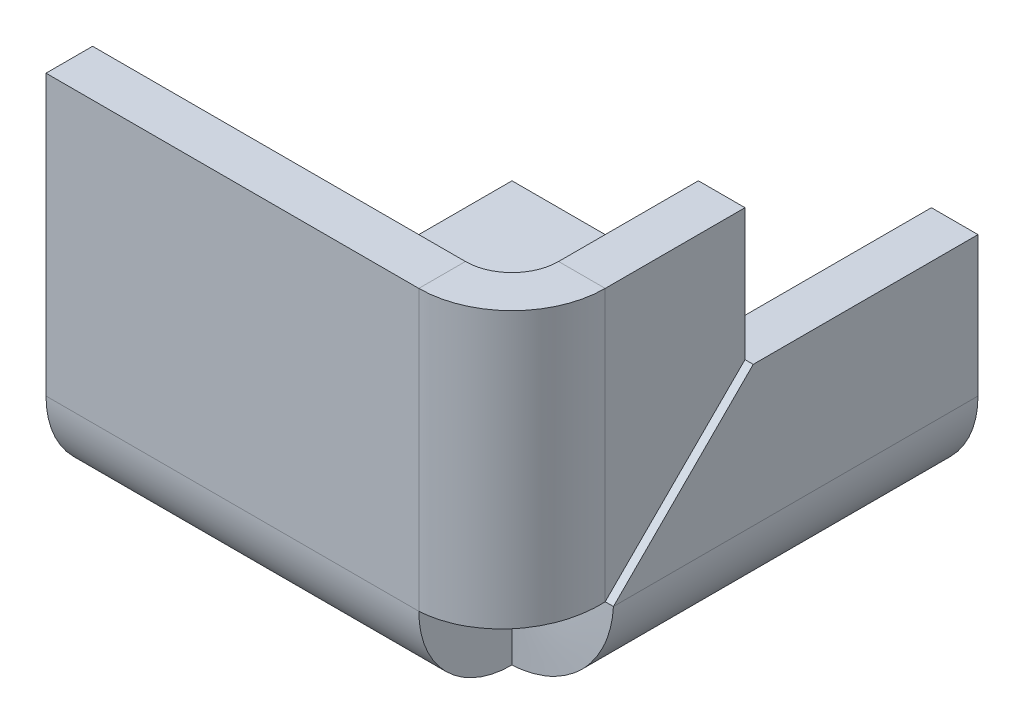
ISO-10303-21;
HEADER;
FILE_DESCRIPTION(('STEP AP214'),'2;1');
FILE_NAME('part.step','',(''),(''),'','','');
FILE_SCHEMA(('AUTOMOTIVE_DESIGN { 1 0 10303 214 1 1 1 1 }'));
ENDSEC;
DATA;
#1=APPLICATION_CONTEXT('core data for automotive mechanical design processes');
#2=APPLICATION_PROTOCOL_DEFINITION('international standard','automotive_design',2000,#1);
#3=PRODUCT_CONTEXT('',#1,'mechanical');
#4=PRODUCT('Part','Part','',(#3));
#5=PRODUCT_RELATED_PRODUCT_CATEGORY('part','',(#4));
#6=PRODUCT_DEFINITION_FORMATION('','',#4);
#7=PRODUCT_DEFINITION_CONTEXT('part definition',#1,'design');
#8=PRODUCT_DEFINITION('design','',#6,#7);
#9=PRODUCT_DEFINITION_SHAPE('','',#8);
#10=(LENGTH_UNIT() NAMED_UNIT(*) SI_UNIT(.MILLI.,.METRE.));
#11=(NAMED_UNIT(*) PLANE_ANGLE_UNIT() SI_UNIT($,.RADIAN.));
#12=(NAMED_UNIT(*) SI_UNIT($,.STERADIAN.) SOLID_ANGLE_UNIT());
#13=UNCERTAINTY_MEASURE_WITH_UNIT(LENGTH_MEASURE(1.E-05),#10,'distance_accuracy_value','');
#14=(GEOMETRIC_REPRESENTATION_CONTEXT(3) GLOBAL_UNCERTAINTY_ASSIGNED_CONTEXT((#13)) GLOBAL_UNIT_ASSIGNED_CONTEXT((#10,
#11,#12)) REPRESENTATION_CONTEXT('',''));
#15=CARTESIAN_POINT('',(0.,0.,0.));
#16=DIRECTION('',(0.,0.,1.));
#17=DIRECTION('',(1.,0.,0.));
#18=AXIS2_PLACEMENT_3D('',#15,#16,#17);
#19=CARTESIAN_POINT('',(3.00000000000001,2.,3.));
#20=DIRECTION('',(1.,0.,0.));
#21=DIRECTION('',(0.,0.,-1.));
#22=AXIS2_PLACEMENT_3D('',#19,#20,#21);
#23=PLANE('',#22);
#24=DIRECTION('',(0.,-1.,0.));
#25=VECTOR('',#24,1.);
#26=CARTESIAN_POINT('',(3.00000000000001,0.999999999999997,3.));
#27=LINE('',#26,#25);
#28=CARTESIAN_POINT('',(3.00000000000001,0.999999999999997,3.));
#29=VERTEX_POINT('',#28);
#30=CARTESIAN_POINT('',(3.00000000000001,0.,3.));
#31=VERTEX_POINT('',#30);
#32=EDGE_CURVE('E113',#29,#31,#27,.T.);
#33=ORIENTED_EDGE('',*,*,#32,.F.);
#34=CARTESIAN_POINT('',(3.00000000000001,2.,3.));
#35=DIRECTION('',(1.,0.,0.));
#36=DIRECTION('',(0.,0.,-1.));
#37=AXIS2_PLACEMENT_3D('',#34,#35,#36);
#38=CIRCLE('',#37,1.);
#39=CARTESIAN_POINT('',(3.00000000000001,2.,4.));
#40=VERTEX_POINT('',#39);
#41=EDGE_CURVE('E14',#29,#40,#38,.F.);
#42=ORIENTED_EDGE('',*,*,#41,.T.);
#43=DIRECTION('',(0.,0.,1.));
#44=VECTOR('',#43,1.);
#45=CARTESIAN_POINT('',(3.00000000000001,2.,4.));
#46=LINE('',#45,#44);
#47=CARTESIAN_POINT('',(3.00000000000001,2.,5.));
#48=VERTEX_POINT('',#47);
#49=EDGE_CURVE('E350',#40,#48,#46,.T.);
#50=ORIENTED_EDGE('',*,*,#49,.T.);
#51=CARTESIAN_POINT('',(3.00000000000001,2.,3.));
#52=DIRECTION('',(1.,0.,0.));
#53=DIRECTION('',(0.,0.,-1.));
#54=AXIS2_PLACEMENT_3D('',#51,#52,#53);
#55=CIRCLE('',#54,2.);
#56=EDGE_CURVE('E107',#31,#48,#55,.F.);
#57=ORIENTED_EDGE('',*,*,#56,.F.);
#58=EDGE_LOOP('',(#33,#42,#50,#57));
#59=FACE_BOUND('',#58,.T.);
#60=ADVANCED_FACE('F100',(#59),#23,.T.);
#61=CARTESIAN_POINT('',(0.,1.,0.));
#62=DIRECTION('',(0.,-1.,0.));
#63=DIRECTION('',(0.,0.,-1.));
#64=AXIS2_PLACEMENT_3D('',#61,#62,#63);
#65=PLANE('',#64);
#66=DIRECTION('',(0.,0.,-1.));
#67=VECTOR('',#66,1.);
#68=CARTESIAN_POINT('',(3.00000000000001,1.,-5.));
#69=LINE('',#68,#67);
#70=CARTESIAN_POINT('',(3.00000000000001,1.,-5.));
#71=VERTEX_POINT('',#70);
#72=EDGE_CURVE('E258',#71,#29,#69,.F.);
#73=ORIENTED_EDGE('',*,*,#72,.F.);
#74=DIRECTION('',(-1.,0.,0.));
#75=VECTOR('',#74,1.);
#76=CARTESIAN_POINT('',(-5.,1.,-5.));
#77=LINE('',#76,#75);
#78=CARTESIAN_POINT('',(-5.,1.,-5.));
#79=VERTEX_POINT('',#78);
#80=EDGE_CURVE('E386',#71,#79,#77,.T.);
#81=ORIENTED_EDGE('',*,*,#80,.T.);
#82=DIRECTION('',(0.,0.,1.));
#83=VECTOR('',#82,1.);
#84=CARTESIAN_POINT('',(-5.,1.,5.));
#85=LINE('',#84,#83);
#86=CARTESIAN_POINT('',(-5.,0.999999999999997,3.));
#87=VERTEX_POINT('',#86);
#88=EDGE_CURVE('E388',#79,#87,#85,.T.);
#89=ORIENTED_EDGE('',*,*,#88,.T.);
#90=DIRECTION('',(1.,0.,0.));
#91=VECTOR('',#90,1.);
#92=CARTESIAN_POINT('',(5.,0.999999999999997,3.));
#93=LINE('',#92,#91);
#94=EDGE_CURVE('E355',#29,#87,#93,.F.);
#95=ORIENTED_EDGE('',*,*,#94,.F.);
#96=EDGE_LOOP('',(#73,#81,#89,#95));
#97=FACE_BOUND('',#96,.T.);
#98=ADVANCED_FACE('F484',(#97),#65,.F.);
#99=CARTESIAN_POINT('',(0.,0.,0.));
#100=DIRECTION('',(0.,-1.,0.));
#101=DIRECTION('',(0.,0.,-1.));
#102=AXIS2_PLACEMENT_3D('',#99,#100,#101);
#103=PLANE('',#102);
#104=DIRECTION('',(-1.,0.,0.));
#105=VECTOR('',#104,1.);
#106=CARTESIAN_POINT('',(-5.,0.,-5.));
#107=LINE('',#106,#105);
#108=CARTESIAN_POINT('',(3.00000000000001,0.,-5.));
#109=VERTEX_POINT('',#108);
#110=CARTESIAN_POINT('',(-5.,0.,-5.));
#111=VERTEX_POINT('',#110);
#112=EDGE_CURVE('E385',#109,#111,#107,.T.);
#113=ORIENTED_EDGE('',*,*,#112,.F.);
#114=DIRECTION('',(0.,0.,-1.));
#115=VECTOR('',#114,1.);
#116=CARTESIAN_POINT('',(3.00000000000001,0.,-5.));
#117=LINE('',#116,#115);
#118=EDGE_CURVE('E253',#109,#31,#117,.F.);
#119=ORIENTED_EDGE('',*,*,#118,.T.);
#120=DIRECTION('',(1.,0.,0.));
#121=VECTOR('',#120,1.);
#122=CARTESIAN_POINT('',(5.,0.,3.));
#123=LINE('',#122,#121);
#124=CARTESIAN_POINT('',(-5.,0.,3.));
#125=VERTEX_POINT('',#124);
#126=EDGE_CURVE('E373',#31,#125,#123,.F.);
#127=ORIENTED_EDGE('',*,*,#126,.T.);
#128=DIRECTION('',(0.,0.,1.));
#129=VECTOR('',#128,1.);
#130=CARTESIAN_POINT('',(-5.,0.,5.));
#131=LINE('',#130,#129);
#132=EDGE_CURVE('E389',#111,#125,#131,.T.);
#133=ORIENTED_EDGE('',*,*,#132,.F.);
#134=EDGE_LOOP('',(#113,#119,#127,#133));
#135=FACE_BOUND('',#134,.T.);
#136=ADVANCED_FACE('F488',(#135),#103,.T.);
#137=CARTESIAN_POINT('',(-5.,1.,-5.));
#138=DIRECTION('',(0.,0.,1.));
#139=DIRECTION('',(1.,0.,0.));
#140=AXIS2_PLACEMENT_3D('',#137,#138,#139);
#141=PLANE('',#140);
#142=DIRECTION('',(0.,-1.,0.));
#143=VECTOR('',#142,1.);
#144=CARTESIAN_POINT('',(3.00000000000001,1.,-5.));
#145=LINE('',#144,#143);
#146=EDGE_CURVE('E434',#71,#109,#145,.T.);
#147=ORIENTED_EDGE('',*,*,#146,.T.);
#148=ORIENTED_EDGE('',*,*,#112,.T.);
#149=DIRECTION('',(0.,-1.,0.));
#150=VECTOR('',#149,1.);
#151=CARTESIAN_POINT('',(-5.,1.,-5.));
#152=LINE('',#151,#150);
#153=EDGE_CURVE('E392',#79,#111,#152,.T.);
#154=ORIENTED_EDGE('',*,*,#153,.F.);
#155=ORIENTED_EDGE('',*,*,#80,.F.);
#156=EDGE_LOOP('',(#147,#148,#154,#155));
#157=FACE_BOUND('',#156,.T.);
#158=ADVANCED_FACE('F480',(#157),#141,.F.);
#159=CARTESIAN_POINT('',(5.,2.,3.));
#160=DIRECTION('',(1.,0.,0.));
#161=DIRECTION('',(0.,0.,1.));
#162=AXIS2_PLACEMENT_3D('',#159,#160,#161);
#163=CYLINDRICAL_SURFACE('',#162,2.);
#164=ORIENTED_EDGE('',*,*,#126,.F.);
#165=ORIENTED_EDGE('',*,*,#56,.T.);
#166=DIRECTION('',(1.,0.,0.));
#167=VECTOR('',#166,1.);
#168=CARTESIAN_POINT('',(-5.,2.,5.));
#169=LINE('',#168,#167);
#170=CARTESIAN_POINT('',(-5.,2.,5.));
#171=VERTEX_POINT('',#170);
#172=EDGE_CURVE('E366',#48,#171,#169,.F.);
#173=ORIENTED_EDGE('',*,*,#172,.T.);
#174=CARTESIAN_POINT('',(-5.,2.,3.));
#175=DIRECTION('',(1.,0.,0.));
#176=DIRECTION('',(0.,0.,-1.));
#177=AXIS2_PLACEMENT_3D('',#174,#175,#176);
#178=CIRCLE('',#177,2.);
#179=EDGE_CURVE('E375',#125,#171,#178,.F.);
#180=ORIENTED_EDGE('',*,*,#179,.F.);
#181=EDGE_LOOP('',(#164,#165,#173,#180));
#182=FACE_BOUND('',#181,.T.);
#183=ADVANCED_FACE('F400',(#182),#163,.T.);
#184=CARTESIAN_POINT('',(0.,0.,5.));
#185=DIRECTION('',(0.,0.,-1.));
#186=DIRECTION('',(-1.,0.,0.));
#187=AXIS2_PLACEMENT_3D('',#184,#185,#186);
#188=PLANE('',#187);
#189=DIRECTION('',(0.,-1.,0.));
#190=VECTOR('',#189,1.);
#191=CARTESIAN_POINT('',(3.00000000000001,2.,5.));
#192=LINE('',#191,#190);
#193=CARTESIAN_POINT('',(3.00000000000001,8.,5.));
#194=VERTEX_POINT('',#193);
#195=EDGE_CURVE('E330',#48,#194,#192,.F.);
#196=ORIENTED_EDGE('',*,*,#195,.T.);
#197=DIRECTION('',(-1.,0.,0.));
#198=VECTOR('',#197,1.);
#199=CARTESIAN_POINT('',(0.,8.,5.));
#200=LINE('',#199,#198);
#201=CARTESIAN_POINT('',(-5.,8.,5.));
#202=VERTEX_POINT('',#201);
#203=EDGE_CURVE('E356',#194,#202,#200,.T.);
#204=ORIENTED_EDGE('',*,*,#203,.T.);
#205=DIRECTION('',(0.,-1.,0.));
#206=VECTOR('',#205,1.);
#207=CARTESIAN_POINT('',(-5.,0.,5.));
#208=LINE('',#207,#206);
#209=EDGE_CURVE('E358',#202,#171,#208,.T.);
#210=ORIENTED_EDGE('',*,*,#209,.T.);
#211=ORIENTED_EDGE('',*,*,#172,.F.);
#212=EDGE_LOOP('',(#196,#204,#210,#211));
#213=FACE_BOUND('',#212,.T.);
#214=ADVANCED_FACE('F472',(#213),#188,.F.);
#215=CARTESIAN_POINT('',(0.,0.,4.));
#216=DIRECTION('',(0.,0.,-1.));
#217=DIRECTION('',(-1.,0.,0.));
#218=AXIS2_PLACEMENT_3D('',#215,#216,#217);
#219=PLANE('',#218);
#220=DIRECTION('',(1.,0.,0.));
#221=VECTOR('',#220,1.);
#222=CARTESIAN_POINT('',(-5.,8.,4.));
#223=LINE('',#222,#221);
#224=CARTESIAN_POINT('',(3.00000000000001,8.,4.));
#225=VERTEX_POINT('',#224);
#226=CARTESIAN_POINT('',(-5.,8.,4.));
#227=VERTEX_POINT('',#226);
#228=EDGE_CURVE('E361',#225,#227,#223,.F.);
#229=ORIENTED_EDGE('',*,*,#228,.F.);
#230=DIRECTION('',(0.,-1.,0.));
#231=VECTOR('',#230,1.);
#232=CARTESIAN_POINT('',(3.00000000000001,2.,4.));
#233=LINE('',#232,#231);
#234=EDGE_CURVE('E343',#40,#225,#233,.F.);
#235=ORIENTED_EDGE('',*,*,#234,.F.);
#236=DIRECTION('',(1.,0.,0.));
#237=VECTOR('',#236,1.);
#238=CARTESIAN_POINT('',(-5.,2.,4.));
#239=LINE('',#238,#237);
#240=CARTESIAN_POINT('',(-5.,2.,4.));
#241=VERTEX_POINT('',#240);
#242=EDGE_CURVE('E368',#241,#40,#239,.T.);
#243=ORIENTED_EDGE('',*,*,#242,.F.);
#244=DIRECTION('',(0.,1.,0.));
#245=VECTOR('',#244,1.);
#246=CARTESIAN_POINT('',(-5.,1.,4.));
#247=LINE('',#246,#245);
#248=EDGE_CURVE('E363',#227,#241,#247,.F.);
#249=ORIENTED_EDGE('',*,*,#248,.F.);
#250=EDGE_LOOP('',(#229,#235,#243,#249));
#251=FACE_BOUND('',#250,.T.);
#252=ADVANCED_FACE('F467',(#251),#219,.T.);
#253=CARTESIAN_POINT('',(-5.,8.,5.));
#254=DIRECTION('',(0.,-1.,0.));
#255=DIRECTION('',(0.,0.,-1.));
#256=AXIS2_PLACEMENT_3D('',#253,#254,#255);
#257=PLANE('',#256);
#258=DIRECTION('',(0.,0.,1.));
#259=VECTOR('',#258,1.);
#260=CARTESIAN_POINT('',(3.00000000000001,8.,4.));
#261=LINE('',#260,#259);
#262=EDGE_CURVE('E346',#225,#194,#261,.T.);
#263=ORIENTED_EDGE('',*,*,#262,.F.);
#264=ORIENTED_EDGE('',*,*,#228,.T.);
#265=DIRECTION('',(0.,0.,-1.));
#266=VECTOR('',#265,1.);
#267=CARTESIAN_POINT('',(-5.,8.,5.));
#268=LINE('',#267,#266);
#269=EDGE_CURVE('E352',#202,#227,#268,.T.);
#270=ORIENTED_EDGE('',*,*,#269,.F.);
#271=ORIENTED_EDGE('',*,*,#203,.F.);
#272=EDGE_LOOP('',(#263,#264,#270,#271));
#273=FACE_BOUND('',#272,.T.);
#274=ADVANCED_FACE('F463',(#273),#257,.F.);
#275=CARTESIAN_POINT('',(-5.,1.,5.));
#276=DIRECTION('',(1.,0.,0.));
#277=DIRECTION('',(0.,0.,-1.));
#278=AXIS2_PLACEMENT_3D('',#275,#276,#277);
#279=PLANE('',#278);
#280=DIRECTION('',(0.,-1.,0.));
#281=VECTOR('',#280,1.);
#282=CARTESIAN_POINT('',(-5.,0.999999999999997,3.));
#283=LINE('',#282,#281);
#284=EDGE_CURVE('E379',#87,#125,#283,.T.);
#285=ORIENTED_EDGE('',*,*,#284,.F.);
#286=ORIENTED_EDGE('',*,*,#88,.F.);
#287=ORIENTED_EDGE('',*,*,#153,.T.);
#288=ORIENTED_EDGE('',*,*,#132,.T.);
#289=EDGE_LOOP('',(#285,#286,#287,#288));
#290=FACE_BOUND('',#289,.T.);
#291=ADVANCED_FACE('F500',(#290),#279,.F.);
#292=CARTESIAN_POINT('',(-5.,2.,3.));
#293=DIRECTION('',(-1.,0.,0.));
#294=DIRECTION('',(0.,0.,1.));
#295=AXIS2_PLACEMENT_3D('',#292,#293,#294);
#296=PLANE('',#295);
#297=DIRECTION('',(0.,0.,-1.));
#298=VECTOR('',#297,1.);
#299=CARTESIAN_POINT('',(-5.,2.,5.));
#300=LINE('',#299,#298);
#301=EDGE_CURVE('E349',#241,#171,#300,.F.);
#302=ORIENTED_EDGE('',*,*,#301,.F.);
#303=CARTESIAN_POINT('',(-5.,2.,3.));
#304=DIRECTION('',(1.,0.,0.));
#305=DIRECTION('',(0.,0.,-1.));
#306=AXIS2_PLACEMENT_3D('',#303,#304,#305);
#307=CIRCLE('',#306,1.);
#308=EDGE_CURVE('E376',#87,#241,#307,.F.);
#309=ORIENTED_EDGE('',*,*,#308,.F.);
#310=ORIENTED_EDGE('',*,*,#284,.T.);
#311=ORIENTED_EDGE('',*,*,#179,.T.);
#312=EDGE_LOOP('',(#302,#309,#310,#311));
#313=FACE_BOUND('',#312,.T.);
#314=ADVANCED_FACE('F497',(#313),#296,.T.);
#315=CARTESIAN_POINT('',(5.,2.,3.));
#316=DIRECTION('',(1.,0.,0.));
#317=DIRECTION('',(0.,0.,1.));
#318=AXIS2_PLACEMENT_3D('',#315,#316,#317);
#319=CYLINDRICAL_SURFACE('',#318,1.);
#320=ORIENTED_EDGE('',*,*,#41,.F.);
#321=ORIENTED_EDGE('',*,*,#94,.T.);
#322=ORIENTED_EDGE('',*,*,#308,.T.);
#323=ORIENTED_EDGE('',*,*,#242,.T.);
#324=EDGE_LOOP('',(#320,#321,#322,#323));
#325=FACE_BOUND('',#324,.T.);
#326=ADVANCED_FACE('F531',(#325),#319,.F.);
#327=CARTESIAN_POINT('',(-5.,1.,5.));
#328=DIRECTION('',(1.,0.,0.));
#329=DIRECTION('',(0.,0.,-1.));
#330=AXIS2_PLACEMENT_3D('',#327,#328,#329);
#331=PLANE('',#330);
#332=ORIENTED_EDGE('',*,*,#301,.T.);
#333=ORIENTED_EDGE('',*,*,#209,.F.);
#334=ORIENTED_EDGE('',*,*,#269,.T.);
#335=ORIENTED_EDGE('',*,*,#248,.T.);
#336=EDGE_LOOP('',(#332,#333,#334,#335));
#337=FACE_BOUND('',#336,.T.);
#338=ADVANCED_FACE('F470',(#337),#331,.F.);
#339=CARTESIAN_POINT('',(3.00000000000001,8.,3.));
#340=DIRECTION('',(0.,1.,0.));
#341=DIRECTION('',(0.,0.,1.));
#342=AXIS2_PLACEMENT_3D('',#339,#340,#341);
#343=PLANE('',#342);
#344=DIRECTION('',(-1.,0.,0.));
#345=VECTOR('',#344,1.);
#346=CARTESIAN_POINT('',(5.00000000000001,8.,3.00000000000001));
#347=LINE('',#346,#345);
#348=CARTESIAN_POINT('',(4.00000000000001,8.,3.));
#349=VERTEX_POINT('',#348);
#350=CARTESIAN_POINT('',(5.00000000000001,8.,3.00000000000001));
#351=VERTEX_POINT('',#350);
#352=EDGE_CURVE('E438',#349,#351,#347,.F.);
#353=ORIENTED_EDGE('',*,*,#352,.F.);
#354=CARTESIAN_POINT('',(3.00000000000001,8.,3.));
#355=DIRECTION('',(0.,-1.,0.));
#356=DIRECTION('',(0.,0.,-1.));
#357=AXIS2_PLACEMENT_3D('',#354,#355,#356);
#358=CIRCLE('',#357,1.);
#359=EDGE_CURVE('E331',#225,#349,#358,.F.);
#360=ORIENTED_EDGE('',*,*,#359,.F.);
#361=ORIENTED_EDGE('',*,*,#262,.T.);
#362=CARTESIAN_POINT('',(3.00000000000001,8.,3.));
#363=DIRECTION('',(0.,-1.,0.));
#364=DIRECTION('',(0.,0.,-1.));
#365=AXIS2_PLACEMENT_3D('',#362,#363,#364);
#366=CIRCLE('',#365,2.);
#367=EDGE_CURVE('E342',#194,#351,#366,.F.);
#368=ORIENTED_EDGE('',*,*,#367,.T.);
#369=EDGE_LOOP('',(#353,#360,#361,#368));
#370=FACE_BOUND('',#369,.T.);
#371=ADVANCED_FACE('F460',(#370),#343,.T.);
#372=CARTESIAN_POINT('',(5.01000000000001,2.17677669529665,3.00000000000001));
#373=CARTESIAN_POINT('',(5.01,2.16204265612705,3.2631556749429));
#374=CARTESIAN_POINT('',(4.95768508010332,2.14731391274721,3.52611324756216));
#375=CARTESIAN_POINT('',(4.75631064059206,2.11785113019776,4.01227415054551));
#376=CARTESIAN_POINT('',(4.60733035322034,2.10311973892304,4.23523890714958));
#377=CARTESIAN_POINT('',(4.23523890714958,2.0736569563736,4.60733035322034));
#378=CARTESIAN_POINT('',(4.01227415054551,2.05892556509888,4.75631064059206));
#379=CARTESIAN_POINT('',(3.52611324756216,2.02946278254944,4.95768508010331));
#380=CARTESIAN_POINT('',(3.2631556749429,2.01473403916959,5.01));
#381=CARTESIAN_POINT('',(3.00000000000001,2.,5.01));
#382=CARTESIAN_POINT('',(5.00000000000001,2.17677669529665,3.00000000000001));
#383=CARTESIAN_POINT('',(5.,2.1620426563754,3.26184644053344));
#384=CARTESIAN_POINT('',(4.94794535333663,2.14731391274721,3.52349576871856));
#385=CARTESIAN_POINT('',(4.74757277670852,2.11785113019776,4.0072379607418));
#386=CARTESIAN_POINT('',(4.59933368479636,2.10311973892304,4.22909343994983));
#387=CARTESIAN_POINT('',(4.22909343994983,2.0736569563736,4.59933368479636));
#388=CARTESIAN_POINT('',(4.0072379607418,2.05892556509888,4.74757277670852));
#389=CARTESIAN_POINT('',(3.52349576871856,2.02946278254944,4.94794535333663));
#390=CARTESIAN_POINT('',(3.26184644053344,2.01473403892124,5.));
#391=CARTESIAN_POINT('',(3.00000000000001,2.,5.));
#392=CARTESIAN_POINT('',(4.00000000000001,2.17677669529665,3.));
#393=CARTESIAN_POINT('',(4.,2.16204268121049,3.13092299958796));
#394=CARTESIAN_POINT('',(3.97397267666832,2.14731391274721,3.26174788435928));
#395=CARTESIAN_POINT('',(3.87378638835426,2.11785113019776,3.5036189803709));
#396=CARTESIAN_POINT('',(3.79966684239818,2.10311973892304,3.61454671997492));
#397=CARTESIAN_POINT('',(3.61454671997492,2.0736569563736,3.79966684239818));
#398=CARTESIAN_POINT('',(3.5036189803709,2.05892556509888,3.87378638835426));
#399=CARTESIAN_POINT('',(3.26174788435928,2.02946278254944,3.97397267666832));
#400=CARTESIAN_POINT('',(3.13092299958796,2.01473401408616,4.));
#401=CARTESIAN_POINT('',(3.00000000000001,2.,4.));
#402=CARTESIAN_POINT('',(3.98990000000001,2.17677669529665,3.));
#403=CARTESIAN_POINT('',(3.9899,2.16204268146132,3.12960067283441));
#404=CARTESIAN_POINT('',(3.96413555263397,2.14731391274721,3.25910423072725));
#405=CARTESIAN_POINT('',(3.86496114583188,2.11785113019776,3.49853242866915));
#406=CARTESIAN_POINT('',(3.79159020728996,2.10311973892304,3.60833979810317));
#407=CARTESIAN_POINT('',(3.60833979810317,2.0736569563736,3.79159020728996));
#408=CARTESIAN_POINT('',(3.49853242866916,2.05892556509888,3.86496114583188));
#409=CARTESIAN_POINT('',(3.25910423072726,2.02946278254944,3.96413555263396));
#410=CARTESIAN_POINT('',(3.12960067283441,2.01473401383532,3.9899));
#411=CARTESIAN_POINT('',(3.00000000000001,2.,3.9899));
#412=B_SPLINE_SURFACE_WITH_KNOTS('',1,3,((#372,#373,#374,#375,#376,#377,#378,#379,#380,#381),
(#382,#383,#384,#385,#386,#387,#388,#389,#390,#391),(#392,#393,#394,#395,#396,#397,#398,#399,
#400,#401),(#402,#403,#404,#405,#406,#407,#408,#409,#410,#411)),.UNSPECIFIED.,.F.,.F.,.F.,(2,1,
1,2),(4,2,2,2,4),(-0.01,0.,1.,1.0101),(0.,0.25,0.5,0.75,1.),.UNSPECIFIED.);
#413=CARTESIAN_POINT('',(4.00000000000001,2.17677669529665,3.));
#414=CARTESIAN_POINT('',(4.00000034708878,2.17493527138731,3.01636247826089));
#415=CARTESIAN_POINT('',(3.99959841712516,2.17309384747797,3.03272492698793));
#416=CARTESIAN_POINT('',(3.9979924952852,2.16941099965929,3.06541042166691));
#417=CARTESIAN_POINT('',(3.99678850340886,2.16756957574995,3.08173346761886));
#418=CARTESIAN_POINT('',(3.99358094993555,2.16388672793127,3.11430081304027));
#419=CARTESIAN_POINT('',(3.99157738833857,2.16204530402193,3.13054511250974));
#420=CARTESIAN_POINT('',(3.986775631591,2.15836245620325,3.16291583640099));
#421=CARTESIAN_POINT('',(3.98397743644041,2.15652103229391,3.17904226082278));
#422=CARTESIAN_POINT('',(3.97759312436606,2.15283818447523,3.21113838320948));
#423=CARTESIAN_POINT('',(3.9740070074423,2.15099676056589,3.22710808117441));
#424=CARTESIAN_POINT('',(3.9660554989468,2.14731391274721,3.25885227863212));
#425=CARTESIAN_POINT('',(3.96169010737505,2.14547248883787,3.27462677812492));
#426=CARTESIAN_POINT('',(3.95219056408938,2.14178964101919,3.30594257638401));
#427=CARTESIAN_POINT('',(3.94705641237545,2.13994821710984,3.32148387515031));
#428=CARTESIAN_POINT('',(3.9360317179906,2.13626536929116,3.35229583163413));
#429=CARTESIAN_POINT('',(3.93014117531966,2.13442394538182,3.36756648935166));
#430=CARTESIAN_POINT('',(3.91761788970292,2.13074109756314,3.39780037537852));
#431=CARTESIAN_POINT('',(3.9109851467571,2.1288996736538,3.41276360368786));
#432=CARTESIAN_POINT('',(3.89699343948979,2.12521682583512,3.44234658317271));
#433=CARTESIAN_POINT('',(3.8896344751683,2.12337540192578,3.45696633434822));
#434=CARTESIAN_POINT('',(3.87420805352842,2.1196925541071,3.48582713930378));
#435=CARTESIAN_POINT('',(3.86614059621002,2.11785113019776,3.50006819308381));
#436=CARTESIAN_POINT('',(3.84931662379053,2.11416828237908,3.52813729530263));
#437=CARTESIAN_POINT('',(3.84056010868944,2.11232685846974,3.54196534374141));
#438=CARTESIAN_POINT('',(3.82237911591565,2.10864401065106,3.56917512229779));
#439=CARTESIAN_POINT('',(3.81295463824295,2.10680258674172,3.5825568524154));
#440=CARTESIAN_POINT('',(3.79346042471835,2.10311973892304,3.60884175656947));
#441=CARTESIAN_POINT('',(3.78339068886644,2.1012783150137,3.62174493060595));
#442=CARTESIAN_POINT('',(3.76263021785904,2.09759546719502,3.64704163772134));
#443=CARTESIAN_POINT('',(3.75193948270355,2.09575404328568,3.65943517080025));
#444=CARTESIAN_POINT('',(3.72996276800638,2.092071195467,3.68368273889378));
#445=CARTESIAN_POINT('',(3.7186767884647,2.09022977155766,3.6955367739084));
#446=CARTESIAN_POINT('',(3.6955367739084,2.08654692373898,3.7186767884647));
#447=CARTESIAN_POINT('',(3.68368273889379,2.08470549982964,3.72996276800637));
#448=CARTESIAN_POINT('',(3.65943517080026,2.08102265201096,3.75193948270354));
#449=CARTESIAN_POINT('',(3.64704163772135,2.07918122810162,3.76263021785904));
#450=CARTESIAN_POINT('',(3.62174493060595,2.07549838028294,3.78339068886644));
#451=CARTESIAN_POINT('',(3.60884175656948,2.0736569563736,3.79346042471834));
#452=CARTESIAN_POINT('',(3.5825568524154,2.06997410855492,3.81295463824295));
#453=CARTESIAN_POINT('',(3.5691751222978,2.06813268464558,3.82237911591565));
#454=CARTESIAN_POINT('',(3.54196534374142,2.0644498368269,3.84056010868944));
#455=CARTESIAN_POINT('',(3.52813729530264,2.06260841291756,3.84931662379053));
#456=CARTESIAN_POINT('',(3.50006819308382,2.05892556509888,3.86614059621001));
#457=CARTESIAN_POINT('',(3.48582713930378,2.05708414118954,3.87420805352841));
#458=CARTESIAN_POINT('',(3.45696633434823,2.05340129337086,3.8896344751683));
#459=CARTESIAN_POINT('',(3.44234658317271,2.05155986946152,3.89699343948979));
#460=CARTESIAN_POINT('',(3.41276360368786,2.04787702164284,3.9109851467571));
#461=CARTESIAN_POINT('',(3.39780037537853,2.0460355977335,3.91761788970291));
#462=CARTESIAN_POINT('',(3.36756648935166,2.04235274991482,3.93014117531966));
#463=CARTESIAN_POINT('',(3.35229583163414,2.04051132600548,3.93603171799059));
#464=CARTESIAN_POINT('',(3.32148387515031,2.0368284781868,3.94705641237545));
#465=CARTESIAN_POINT('',(3.30594257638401,2.03498705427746,3.95219056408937));
#466=CARTESIAN_POINT('',(3.27462677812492,2.03130420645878,3.96169010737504));
#467=CARTESIAN_POINT('',(3.25885227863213,2.02946278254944,3.96605549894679));
#468=CARTESIAN_POINT('',(3.22710808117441,2.02577993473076,3.9740070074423));
#469=CARTESIAN_POINT('',(3.21113838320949,2.02393851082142,3.97759312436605));
#470=CARTESIAN_POINT('',(3.17904226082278,2.02025566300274,3.98397743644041));
#471=CARTESIAN_POINT('',(3.16291583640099,2.0184142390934,3.986775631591));
#472=CARTESIAN_POINT('',(3.13054511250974,2.01473139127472,3.99157738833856));
#473=CARTESIAN_POINT('',(3.11430081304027,2.01288996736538,3.99358094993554));
#474=CARTESIAN_POINT('',(3.08173346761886,2.0092071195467,3.99678850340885));
#475=CARTESIAN_POINT('',(3.06541042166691,2.00736569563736,3.99799249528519));
#476=CARTESIAN_POINT('',(3.03272492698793,2.00368284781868,3.99959841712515));
#477=CARTESIAN_POINT('',(3.0163624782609,2.00184142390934,4.00000034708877));
#478=CARTESIAN_POINT('',(3.00000000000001,2.,4.));
#479=B_SPLINE_CURVE_WITH_KNOTS('',3,(#413,#414,#415,#416,#417,#418,#419,#420,#421,#422,#423,
#424,#425,#426,#427,#428,#429,#430,#431,#432,#433,#434,#435,#436,#437,#438,#439,#440,#441,#442,
#443,#444,#445,#446,#447,#448,#449,#450,#451,#452,#453,#454,#455,#456,#457,#458,#459,#460,#461,
#462,#463,#464,#465,#466,#467,#468,#469,#470,#471,#472,#473,#474,#475,#476,#477,#478),
.UNSPECIFIED.,.F.,.F.,(4,2,2,2,2,2,2,2,2,2,2,2,2,2,2,2,2,2,2,2,2,2,2,2,2,2,2,2,2,2,2,2,4),(0.,
0.0493923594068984,0.0987847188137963,0.148177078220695,0.197569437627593,0.246961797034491,
0.29635415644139,0.345746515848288,0.395138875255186,0.444531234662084,0.493923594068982,
0.543315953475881,0.592708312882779,0.642100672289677,0.691493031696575,0.740885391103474,
0.790277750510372,0.83967010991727,0.889062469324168,0.938454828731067,0.987847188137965,
1.03723954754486,1.08663190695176,1.13602426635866,1.18541662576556,1.23480898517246,
1.28420134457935,1.33359370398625,1.38298606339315,1.43237842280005,1.48177078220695,
1.53116314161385,1.58055550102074),.UNSPECIFIED.);
#480=CARTESIAN_POINT('',(4.00000000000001,2.17677669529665,3.));
#481=VERTEX_POINT('',#480);
#482=EDGE_CURVE('E332',#481,#40,#479,.T.);
#483=DIRECTION('',(1.,0.,0.));
#484=VECTOR('',#483,1.);
#485=CARTESIAN_POINT('',(4.00000000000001,2.17677669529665,3.));
#486=LINE('',#485,#484);
#487=CARTESIAN_POINT('',(5.00000000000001,2.17677669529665,3.00000000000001));
#488=VERTEX_POINT('',#487);
#489=EDGE_CURVE('E413',#488,#481,#486,.F.);
#490=CARTESIAN_POINT('',(5.00000000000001,2.17677669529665,3.00000000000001));
#491=CARTESIAN_POINT('',(5.00000069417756,2.17493527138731,3.03272495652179));
#492=CARTESIAN_POINT('',(4.99919683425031,2.17309384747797,3.06544985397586));
#493=CARTESIAN_POINT('',(4.99598499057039,2.16941099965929,3.13082084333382));
#494=CARTESIAN_POINT('',(4.99357700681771,2.16756957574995,3.16346693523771));
#495=CARTESIAN_POINT('',(4.98716189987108,2.16388672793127,3.22860162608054));
#496=CARTESIAN_POINT('',(4.98315477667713,2.16204530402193,3.26109022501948));
#497=CARTESIAN_POINT('',(4.973551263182,2.15836245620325,3.32583167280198));
#498=CARTESIAN_POINT('',(4.96795487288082,2.15652103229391,3.35808452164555));
#499=CARTESIAN_POINT('',(4.95518624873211,2.15283818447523,3.42227676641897));
#500=CARTESIAN_POINT('',(4.9480140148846,2.15099676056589,3.45421616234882));
#501=CARTESIAN_POINT('',(4.93211099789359,2.14731391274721,3.51770455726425));
#502=CARTESIAN_POINT('',(4.92338021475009,2.14547248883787,3.54925355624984));
#503=CARTESIAN_POINT('',(4.90438112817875,2.14178964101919,3.61188515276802));
#504=CARTESIAN_POINT('',(4.8941128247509,2.13994821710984,3.64296775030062));
#505=CARTESIAN_POINT('',(4.87206343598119,2.13626536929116,3.70459166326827));
#506=CARTESIAN_POINT('',(4.86028235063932,2.13442394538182,3.73513297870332));
#507=CARTESIAN_POINT('',(4.83523577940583,2.13074109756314,3.79560075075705));
#508=CARTESIAN_POINT('',(4.8219702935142,2.1288996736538,3.82552720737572));
#509=CARTESIAN_POINT('',(4.79398687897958,2.12521682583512,3.88469316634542));
#510=CARTESIAN_POINT('',(4.7792689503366,2.12337540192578,3.91393266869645));
#511=CARTESIAN_POINT('',(4.74841610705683,2.1196925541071,3.97165427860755));
#512=CARTESIAN_POINT('',(4.73228119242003,2.11785113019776,4.00013638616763));
#513=CARTESIAN_POINT('',(4.69863324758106,2.11416828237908,4.05627459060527));
#514=CARTESIAN_POINT('',(4.68112021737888,2.11232685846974,4.08393068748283));
#515=CARTESIAN_POINT('',(4.6447582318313,2.10864401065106,4.13835024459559));
#516=CARTESIAN_POINT('',(4.6259092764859,2.10680258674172,4.16511370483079));
#517=CARTESIAN_POINT('',(4.58692084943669,2.10311973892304,4.21768351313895));
#518=CARTESIAN_POINT('',(4.56678137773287,2.1012783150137,4.2434898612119));
#519=CARTESIAN_POINT('',(4.52526043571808,2.09759546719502,4.29408327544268));
#520=CARTESIAN_POINT('',(4.50387896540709,2.09575404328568,4.31887034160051));
#521=CARTESIAN_POINT('',(4.45992553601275,2.092071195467,4.36736547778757));
#522=CARTESIAN_POINT('',(4.43735357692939,2.09022977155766,4.3910735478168));
#523=CARTESIAN_POINT('',(4.3910735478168,2.08654692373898,4.43735357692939));
#524=CARTESIAN_POINT('',(4.36736547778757,2.08470549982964,4.45992553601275));
#525=CARTESIAN_POINT('',(4.31887034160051,2.08102265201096,4.50387896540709));
#526=CARTESIAN_POINT('',(4.29408327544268,2.07918122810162,4.52526043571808));
#527=CARTESIAN_POINT('',(4.2434898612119,2.07549838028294,4.56678137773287));
#528=CARTESIAN_POINT('',(4.21768351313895,2.0736569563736,4.58692084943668));
#529=CARTESIAN_POINT('',(4.16511370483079,2.06997410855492,4.6259092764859));
#530=CARTESIAN_POINT('',(4.13835024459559,2.06813268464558,4.6447582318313));
#531=CARTESIAN_POINT('',(4.08393068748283,2.0644498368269,4.68112021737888));
#532=CARTESIAN_POINT('',(4.05627459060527,2.06260841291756,4.69863324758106));
#533=CARTESIAN_POINT('',(4.00013638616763,2.05892556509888,4.73228119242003));
#534=CARTESIAN_POINT('',(3.97165427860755,2.05708414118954,4.74841610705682));
#535=CARTESIAN_POINT('',(3.91393266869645,2.05340129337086,4.7792689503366));
#536=CARTESIAN_POINT('',(3.88469316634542,2.05155986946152,4.79398687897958));
#537=CARTESIAN_POINT('',(3.82552720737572,2.04787702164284,4.82197029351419));
#538=CARTESIAN_POINT('',(3.79560075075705,2.0460355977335,4.83523577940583));
#539=CARTESIAN_POINT('',(3.73513297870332,2.04235274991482,4.86028235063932));
#540=CARTESIAN_POINT('',(3.70459166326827,2.04051132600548,4.87206343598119));
#541=CARTESIAN_POINT('',(3.64296775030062,2.0368284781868,4.8941128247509));
#542=CARTESIAN_POINT('',(3.61188515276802,2.03498705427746,4.90438112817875));
#543=CARTESIAN_POINT('',(3.54925355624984,2.03130420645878,4.92338021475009));
#544=CARTESIAN_POINT('',(3.51770455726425,2.02946278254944,4.93211099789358));
#545=CARTESIAN_POINT('',(3.45421616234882,2.02577993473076,4.94801401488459));
#546=CARTESIAN_POINT('',(3.42227676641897,2.02393851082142,4.95518624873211));
#547=CARTESIAN_POINT('',(3.35808452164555,2.02025566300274,4.96795487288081));
#548=CARTESIAN_POINT('',(3.32583167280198,2.0184142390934,4.97355126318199));
#549=CARTESIAN_POINT('',(3.26109022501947,2.01473139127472,4.98315477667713));
#550=CARTESIAN_POINT('',(3.22860162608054,2.01288996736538,4.98716189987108));
#551=CARTESIAN_POINT('',(3.16346693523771,2.0092071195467,4.99357700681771));
#552=CARTESIAN_POINT('',(3.13082084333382,2.00736569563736,4.99598499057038));
#553=CARTESIAN_POINT('',(3.06544985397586,2.00368284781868,4.9991968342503));
#554=CARTESIAN_POINT('',(3.03272495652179,2.00184142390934,5.00000069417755));
#555=CARTESIAN_POINT('',(3.00000000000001,2.,5.));
#556=B_SPLINE_CURVE_WITH_KNOTS('',3,(#490,#491,#492,#493,#494,#495,#496,#497,#498,#499,#500,
#501,#502,#503,#504,#505,#506,#507,#508,#509,#510,#511,#512,#513,#514,#515,#516,#517,#518,#519,
#520,#521,#522,#523,#524,#525,#526,#527,#528,#529,#530,#531,#532,#533,#534,#535,#536,#537,#538,
#539,#540,#541,#542,#543,#544,#545,#546,#547,#548,#549,#550,#551,#552,#553,#554,#555),
.UNSPECIFIED.,.F.,.F.,(4,2,2,2,2,2,2,2,2,2,2,2,2,2,2,2,2,2,2,2,2,2,2,2,2,2,2,2,2,2,2,2,4),(0.,
0.0983202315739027,0.196640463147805,0.294960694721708,0.39328092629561,0.491601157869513,
0.589921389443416,0.688241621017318,0.78656185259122,0.884882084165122,0.983202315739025,
1.08152254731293,1.17984277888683,1.27816301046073,1.37648324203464,1.47480347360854,
1.57312370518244,1.67144393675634,1.76976416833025,1.86808439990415,1.96640463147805,
2.06472486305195,2.16304509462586,2.26136532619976,2.35968555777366,2.45800578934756,
2.55632602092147,2.65464625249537,2.75296648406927,2.85128671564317,2.94960694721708,
3.04792717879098,3.14624741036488),.UNSPECIFIED.);
#557=EDGE_CURVE('E325',#488,#48,#556,.T.);
#558=ORIENTED_EDGE('',*,*,#482,.F.);
#559=ORIENTED_EDGE('',*,*,#489,.F.);
#560=ORIENTED_EDGE('',*,*,#557,.T.);
#561=ORIENTED_EDGE('',*,*,#49,.F.);
#562=EDGE_LOOP('',(#558,#559,#560,#561));
#563=FACE_BOUND('',#562,.T.);
#564=ADVANCED_FACE('F320',(#563),#412,.F.);
#565=CARTESIAN_POINT('',(3.00000000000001,2.,3.));
#566=DIRECTION('',(0.,-1.,0.));
#567=DIRECTION('',(1.,0.,0.));
#568=AXIS2_PLACEMENT_3D('',#565,#566,#567);
#569=CYLINDRICAL_SURFACE('',#568,2.);
#570=ORIENTED_EDGE('',*,*,#195,.F.);
#571=ORIENTED_EDGE('',*,*,#557,.F.);
#572=DIRECTION('',(0.,-1.,0.));
#573=VECTOR('',#572,1.);
#574=CARTESIAN_POINT('',(5.00000000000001,8.,3.00000000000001));
#575=LINE('',#574,#573);
#576=EDGE_CURVE('E421',#488,#351,#575,.F.);
#577=ORIENTED_EDGE('',*,*,#576,.T.);
#578=ORIENTED_EDGE('',*,*,#367,.F.);
#579=EDGE_LOOP('',(#570,#571,#577,#578));
#580=FACE_BOUND('',#579,.T.);
#581=ADVANCED_FACE('F316',(#580),#569,.T.);
#582=CARTESIAN_POINT('',(3.00000000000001,2.,3.));
#583=DIRECTION('',(0.,-1.,0.));
#584=DIRECTION('',(1.,0.,0.));
#585=AXIS2_PLACEMENT_3D('',#582,#583,#584);
#586=CYLINDRICAL_SURFACE('',#585,1.);
#587=ORIENTED_EDGE('',*,*,#234,.T.);
#588=ORIENTED_EDGE('',*,*,#359,.T.);
#589=DIRECTION('',(0.,-1.,0.));
#590=VECTOR('',#589,1.);
#591=CARTESIAN_POINT('',(4.00000000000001,8.,3.));
#592=LINE('',#591,#590);
#593=EDGE_CURVE('E427',#349,#481,#592,.T.);
#594=ORIENTED_EDGE('',*,*,#593,.T.);
#595=ORIENTED_EDGE('',*,*,#482,.T.);
#596=EDGE_LOOP('',(#587,#588,#594,#595));
#597=FACE_BOUND('',#596,.T.);
#598=ADVANCED_FACE('F304',(#597),#586,.F.);
#599=CARTESIAN_POINT('',(5.00000000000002,0.,0.));
#600=DIRECTION('',(-1.,0.,0.));
#601=DIRECTION('',(0.,0.,1.));
#602=AXIS2_PLACEMENT_3D('',#599,#600,#601);
#603=PLANE('',#602);
#604=DIRECTION('',(0.,-0.70710678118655,0.707106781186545));
#605=VECTOR('',#604,1.);
#606=CARTESIAN_POINT('',(5.00000000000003,6.86238923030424,-1.68561253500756));
#607=LINE('',#606,#605);
#608=CARTESIAN_POINT('',(5.00000000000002,5.17677669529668,0.));
#609=VERTEX_POINT('',#608);
#610=EDGE_CURVE('E422',#609,#488,#607,.T.);
#611=ORIENTED_EDGE('',*,*,#610,.F.);
#612=DIRECTION('',(0.,1.,0.));
#613=VECTOR('',#612,1.);
#614=CARTESIAN_POINT('',(5.00000000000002,0.,0.));
#615=LINE('',#614,#613);
#616=CARTESIAN_POINT('',(5.00000000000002,8.,0.));
#617=VERTEX_POINT('',#616);
#618=EDGE_CURVE('E443',#609,#617,#615,.T.);
#619=ORIENTED_EDGE('',*,*,#618,.T.);
#620=DIRECTION('',(0.,0.,1.));
#621=VECTOR('',#620,1.);
#622=CARTESIAN_POINT('',(5.00000000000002,8.,0.));
#623=LINE('',#622,#621);
#624=EDGE_CURVE('E425',#617,#351,#623,.T.);
#625=ORIENTED_EDGE('',*,*,#624,.T.);
#626=ORIENTED_EDGE('',*,*,#576,.F.);
#627=EDGE_LOOP('',(#611,#619,#625,#626));
#628=FACE_BOUND('',#627,.T.);
#629=ADVANCED_FACE('F300',(#628),#603,.F.);
#630=CARTESIAN_POINT('',(4.00000000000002,0.,0.));
#631=DIRECTION('',(-1.,0.,0.));
#632=DIRECTION('',(0.,0.,1.));
#633=AXIS2_PLACEMENT_3D('',#630,#631,#632);
#634=PLANE('',#633);
#635=DIRECTION('',(0.,-1.,0.));
#636=VECTOR('',#635,1.);
#637=CARTESIAN_POINT('',(4.00000000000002,8.,0.));
#638=LINE('',#637,#636);
#639=CARTESIAN_POINT('',(4.00000000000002,5.17677669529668,0.));
#640=VERTEX_POINT('',#639);
#641=CARTESIAN_POINT('',(4.00000000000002,8.,0.));
#642=VERTEX_POINT('',#641);
#643=EDGE_CURVE('E426',#640,#642,#638,.F.);
#644=ORIENTED_EDGE('',*,*,#643,.F.);
#645=DIRECTION('',(0.,-0.70710678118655,0.707106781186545));
#646=VECTOR('',#645,1.);
#647=CARTESIAN_POINT('',(4.00000000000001,2.58838834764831,2.58838834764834));
#648=LINE('',#647,#646);
#649=EDGE_CURVE('E432',#640,#481,#648,.T.);
#650=ORIENTED_EDGE('',*,*,#649,.T.);
#651=ORIENTED_EDGE('',*,*,#593,.F.);
#652=DIRECTION('',(0.,0.,-1.));
#653=VECTOR('',#652,1.);
#654=CARTESIAN_POINT('',(4.,8.,4.));
#655=LINE('',#654,#653);
#656=EDGE_CURVE('E445',#642,#349,#655,.F.);
#657=ORIENTED_EDGE('',*,*,#656,.F.);
#658=EDGE_LOOP('',(#644,#650,#651,#657));
#659=FACE_BOUND('',#658,.T.);
#660=ADVANCED_FACE('F303',(#659),#634,.T.);
#661=CARTESIAN_POINT('',(5.00000000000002,8.,0.));
#662=DIRECTION('',(0.,0.,1.));
#663=DIRECTION('',(1.,0.,0.));
#664=AXIS2_PLACEMENT_3D('',#661,#662,#663);
#665=PLANE('',#664);
#666=DIRECTION('',(1.,0.,0.));
#667=VECTOR('',#666,1.);
#668=CARTESIAN_POINT('',(5.00000000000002,5.17677669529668,0.));
#669=LINE('',#668,#667);
#670=EDGE_CURVE('E430',#640,#609,#669,.T.);
#671=ORIENTED_EDGE('',*,*,#670,.F.);
#672=ORIENTED_EDGE('',*,*,#643,.T.);
#673=DIRECTION('',(-1.,0.,0.));
#674=VECTOR('',#673,1.);
#675=CARTESIAN_POINT('',(5.00000000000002,8.,0.));
#676=LINE('',#675,#674);
#677=EDGE_CURVE('E418',#617,#642,#676,.T.);
#678=ORIENTED_EDGE('',*,*,#677,.F.);
#679=ORIENTED_EDGE('',*,*,#618,.F.);
#680=EDGE_LOOP('',(#671,#672,#678,#679));
#681=FACE_BOUND('',#680,.T.);
#682=ADVANCED_FACE('F308',(#681),#665,.F.);
#683=CARTESIAN_POINT('',(5.,8.,4.));
#684=DIRECTION('',(0.,-1.,0.));
#685=DIRECTION('',(0.,0.,-1.));
#686=AXIS2_PLACEMENT_3D('',#683,#684,#685);
#687=PLANE('',#686);
#688=ORIENTED_EDGE('',*,*,#352,.T.);
#689=ORIENTED_EDGE('',*,*,#624,.F.);
#690=ORIENTED_EDGE('',*,*,#677,.T.);
#691=ORIENTED_EDGE('',*,*,#656,.T.);
#692=EDGE_LOOP('',(#688,#689,#690,#691));
#693=FACE_BOUND('',#692,.T.);
#694=ADVANCED_FACE('F298',(#693),#687,.F.);
#695=CARTESIAN_POINT('',(5.00000000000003,6.86238923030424,-1.68561253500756));
#696=DIRECTION('',(0.,-0.707106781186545,-0.70710678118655));
#697=DIRECTION('',(0.,0.70710678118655,-0.707106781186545));
#698=AXIS2_PLACEMENT_3D('',#695,#696,#697);
#699=PLANE('',#698);
#700=ORIENTED_EDGE('',*,*,#649,.F.);
#701=ORIENTED_EDGE('',*,*,#670,.T.);
#702=ORIENTED_EDGE('',*,*,#610,.T.);
#703=ORIENTED_EDGE('',*,*,#489,.T.);
#704=EDGE_LOOP('',(#700,#701,#702,#703));
#705=FACE_BOUND('',#704,.T.);
#706=ADVANCED_FACE('F286',(#705),#699,.T.);
#707=CARTESIAN_POINT('',(3.00000000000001,-0.010000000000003,3.));
#708=CARTESIAN_POINT('',(3.2631556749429,-0.010000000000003,2.9852659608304));
#709=CARTESIAN_POINT('',(3.52611324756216,0.0423149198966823,2.97053721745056));
#710=CARTESIAN_POINT('',(4.01227415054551,0.243689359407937,2.94107443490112));
#711=CARTESIAN_POINT('',(4.23523890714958,0.392669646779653,2.9263430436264));
#712=CARTESIAN_POINT('',(4.60733035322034,0.764761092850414,2.89688026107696));
#713=CARTESIAN_POINT('',(4.75631064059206,0.987725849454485,2.88214886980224));
#714=CARTESIAN_POINT('',(4.95768508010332,1.47388675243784,2.85268608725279));
#715=CARTESIAN_POINT('',(5.01,1.7368443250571,2.83795734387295));
#716=CARTESIAN_POINT('',(5.01000000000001,1.99999999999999,2.82322330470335));
#717=CARTESIAN_POINT('',(3.00000000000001,0.,3.));
#718=CARTESIAN_POINT('',(3.26184644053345,0.,2.98526596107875));
#719=CARTESIAN_POINT('',(3.52349576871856,0.0520546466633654,2.97053721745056));
#720=CARTESIAN_POINT('',(4.0072379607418,0.25242722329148,2.94107443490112));
#721=CARTESIAN_POINT('',(4.22909343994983,0.400666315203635,2.9263430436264));
#722=CARTESIAN_POINT('',(4.59933368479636,0.770906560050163,2.89688026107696));
#723=CARTESIAN_POINT('',(4.74757277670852,0.992762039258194,2.88214886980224));
#724=CARTESIAN_POINT('',(4.94794535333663,1.47650423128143,2.85268608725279));
#725=CARTESIAN_POINT('',(5.,1.73815355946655,2.8379573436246));
#726=CARTESIAN_POINT('',(5.00000000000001,1.99999999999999,2.82322330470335));
#727=CARTESIAN_POINT('',(3.00000000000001,0.999999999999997,3.));
#728=CARTESIAN_POINT('',(3.13092299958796,0.999999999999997,2.98526598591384));
#729=CARTESIAN_POINT('',(3.26174788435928,1.02602732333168,2.97053721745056));
#730=CARTESIAN_POINT('',(3.5036189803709,1.12621361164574,2.94107443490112));
#731=CARTESIAN_POINT('',(3.61454671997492,1.20033315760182,2.9263430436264));
#732=CARTESIAN_POINT('',(3.79966684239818,1.38545328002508,2.89688026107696));
#733=CARTESIAN_POINT('',(3.87378638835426,1.4963810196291,2.88214886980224));
#734=CARTESIAN_POINT('',(3.97397267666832,1.73825211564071,2.85268608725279));
#735=CARTESIAN_POINT('',(4.,1.86907700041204,2.83795731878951));
#736=CARTESIAN_POINT('',(4.00000000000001,1.99999999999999,2.82322330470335));
#737=CARTESIAN_POINT('',(3.00000000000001,1.0101,3.));
#738=CARTESIAN_POINT('',(3.12960067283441,1.0101,2.98526598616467));
#739=CARTESIAN_POINT('',(3.25910423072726,1.03586444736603,2.97053721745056));
#740=CARTESIAN_POINT('',(3.49853242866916,1.13503885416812,2.94107443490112));
#741=CARTESIAN_POINT('',(3.60833979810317,1.20840979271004,2.9263430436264));
#742=CARTESIAN_POINT('',(3.79159020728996,1.39166020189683,2.89688026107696));
#743=CARTESIAN_POINT('',(3.86496114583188,1.50146757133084,2.88214886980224));
#744=CARTESIAN_POINT('',(3.96413555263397,1.74089576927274,2.85268608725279));
#745=CARTESIAN_POINT('',(3.9899,1.87039932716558,2.83795731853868));
#746=CARTESIAN_POINT('',(3.98990000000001,1.99999999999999,2.82322330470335));
#747=B_SPLINE_SURFACE_WITH_KNOTS('',1,3,((#707,#708,#709,#710,#711,#712,#713,#714,#715,#716),
(#717,#718,#719,#720,#721,#722,#723,#724,#725,#726),(#727,#728,#729,#730,#731,#732,#733,#734,
#735,#736),(#737,#738,#739,#740,#741,#742,#743,#744,#745,#746)),.UNSPECIFIED.,.F.,.F.,.F.,(2,1,
1,2),(4,2,2,2,4),(-0.01,0.,1.,1.0101),(0.,0.25,0.5,0.75,1.),.UNSPECIFIED.);
#748=DIRECTION('',(-1.,0.,0.));
#749=VECTOR('',#748,1.);
#750=CARTESIAN_POINT('',(4.00000000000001,1.99999999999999,2.82322330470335));
#751=LINE('',#750,#749);
#752=CARTESIAN_POINT('',(5.00000000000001,1.99999999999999,2.82322330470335));
#753=VERTEX_POINT('',#752);
#754=CARTESIAN_POINT('',(4.00000000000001,1.99999999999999,2.82322330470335));
#755=VERTEX_POINT('',#754);
#756=EDGE_CURVE('E215',#753,#755,#751,.T.);
#757=CARTESIAN_POINT('',(3.00000000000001,0.999999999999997,3.));
#758=CARTESIAN_POINT('',(3.0163624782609,0.999999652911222,2.99815857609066));
#759=CARTESIAN_POINT('',(3.03272492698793,1.00040158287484,2.99631715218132));
#760=CARTESIAN_POINT('',(3.06541042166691,1.0020075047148,2.99263430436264));
#761=CARTESIAN_POINT('',(3.08173346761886,1.00321149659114,2.9907928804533));
#762=CARTESIAN_POINT('',(3.11430081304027,1.00641905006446,2.98711003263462));
#763=CARTESIAN_POINT('',(3.13054511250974,1.00842261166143,2.98526860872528));
#764=CARTESIAN_POINT('',(3.16291583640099,1.013224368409,2.9815857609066));
#765=CARTESIAN_POINT('',(3.17904226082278,1.01602256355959,2.97974433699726));
#766=CARTESIAN_POINT('',(3.21113838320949,1.02240687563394,2.97606148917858));
#767=CARTESIAN_POINT('',(3.22710808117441,1.0259929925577,2.97422006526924));
#768=CARTESIAN_POINT('',(3.25885227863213,1.03394450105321,2.97053721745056));
#769=CARTESIAN_POINT('',(3.27462677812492,1.03830989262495,2.96869579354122));
#770=CARTESIAN_POINT('',(3.30594257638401,1.04780943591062,2.96501294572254));
#771=CARTESIAN_POINT('',(3.32148387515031,1.05294358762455,2.9631715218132));
#772=CARTESIAN_POINT('',(3.35229583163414,1.0639682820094,2.95948867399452));
#773=CARTESIAN_POINT('',(3.36756648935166,1.06985882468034,2.95764725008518));
#774=CARTESIAN_POINT('',(3.39780037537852,1.08238211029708,2.9539644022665));
#775=CARTESIAN_POINT('',(3.41276360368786,1.0890148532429,2.95212297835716));
#776=CARTESIAN_POINT('',(3.44234658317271,1.10300656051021,2.94844013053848));
#777=CARTESIAN_POINT('',(3.45696633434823,1.1103655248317,2.94659870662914));
#778=CARTESIAN_POINT('',(3.48582713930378,1.12579194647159,2.94291585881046));
#779=CARTESIAN_POINT('',(3.50006819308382,1.13385940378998,2.94107443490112));
#780=CARTESIAN_POINT('',(3.52813729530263,1.15068337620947,2.93739158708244));
#781=CARTESIAN_POINT('',(3.54196534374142,1.15943989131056,2.9355501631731));
#782=CARTESIAN_POINT('',(3.5691751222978,1.17762088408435,2.93186731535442));
#783=CARTESIAN_POINT('',(3.5825568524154,1.18704536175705,2.93002589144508));
#784=CARTESIAN_POINT('',(3.60884175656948,1.20653957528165,2.9263430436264));
#785=CARTESIAN_POINT('',(3.62174493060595,1.21660931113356,2.92450161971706));
#786=CARTESIAN_POINT('',(3.64704163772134,1.23736978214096,2.92081877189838));
#787=CARTESIAN_POINT('',(3.65943517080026,1.24806051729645,2.91897734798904));
#788=CARTESIAN_POINT('',(3.68368273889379,1.27003723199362,2.91529450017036));
#789=CARTESIAN_POINT('',(3.6955367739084,1.2813232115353,2.91345307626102));
#790=CARTESIAN_POINT('',(3.7186767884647,1.3044632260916,2.90977022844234));
#791=CARTESIAN_POINT('',(3.72996276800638,1.31631726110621,2.907928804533));
#792=CARTESIAN_POINT('',(3.75193948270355,1.34056482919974,2.90424595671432));
#793=CARTESIAN_POINT('',(3.76263021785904,1.35295836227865,2.90240453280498));
#794=CARTESIAN_POINT('',(3.78339068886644,1.37825506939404,2.8987216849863));
#795=CARTESIAN_POINT('',(3.79346042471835,1.39115824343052,2.89688026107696));
#796=CARTESIAN_POINT('',(3.81295463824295,1.4174431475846,2.89319741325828));
#797=CARTESIAN_POINT('',(3.82237911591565,1.4308248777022,2.89135598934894));
#798=CARTESIAN_POINT('',(3.84056010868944,1.45803465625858,2.88767314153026));
#799=CARTESIAN_POINT('',(3.84931662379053,1.47186270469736,2.88583171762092));
#800=CARTESIAN_POINT('',(3.86614059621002,1.49993180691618,2.88214886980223));
#801=CARTESIAN_POINT('',(3.87420805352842,1.51417286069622,2.8803074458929));
#802=CARTESIAN_POINT('',(3.8896344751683,1.54303366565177,2.87662459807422));
#803=CARTESIAN_POINT('',(3.89699343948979,1.55765341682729,2.87478317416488));
#804=CARTESIAN_POINT('',(3.9109851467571,1.58723639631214,2.8711003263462));
#805=CARTESIAN_POINT('',(3.91761788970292,1.60219962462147,2.86925890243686));
#806=CARTESIAN_POINT('',(3.93014117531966,1.63243351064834,2.86557605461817));
#807=CARTESIAN_POINT('',(3.9360317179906,1.64770416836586,2.86373463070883));
#808=CARTESIAN_POINT('',(3.94705641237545,1.67851612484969,2.86005178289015));
#809=CARTESIAN_POINT('',(3.95219056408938,1.69405742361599,2.85821035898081));
#810=CARTESIAN_POINT('',(3.96169010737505,1.72537322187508,2.85452751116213));
#811=CARTESIAN_POINT('',(3.9660554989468,1.74114772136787,2.8526860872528));
#812=CARTESIAN_POINT('',(3.9740070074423,1.77289191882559,2.84900323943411));
#813=CARTESIAN_POINT('',(3.97759312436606,1.78886161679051,2.84716181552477));
#814=CARTESIAN_POINT('',(3.98397743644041,1.82095773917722,2.84347896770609));
#815=CARTESIAN_POINT('',(3.986775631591,1.83708416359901,2.84163754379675));
#816=CARTESIAN_POINT('',(3.99157738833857,1.86945488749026,2.83795469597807));
#817=CARTESIAN_POINT('',(3.99358094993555,1.88569918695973,2.83611327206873));
#818=CARTESIAN_POINT('',(3.99678850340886,1.91826653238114,2.83243042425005));
#819=CARTESIAN_POINT('',(3.9979924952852,1.93458957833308,2.83058900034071));
#820=CARTESIAN_POINT('',(3.99959841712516,1.96727507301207,2.82690615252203));
#821=CARTESIAN_POINT('',(4.00000034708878,1.9836375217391,2.82506472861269));
#822=CARTESIAN_POINT('',(4.00000000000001,1.99999999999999,2.82322330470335));
#823=B_SPLINE_CURVE_WITH_KNOTS('',3,(#757,#758,#759,#760,#761,#762,#763,#764,#765,#766,#767,
#768,#769,#770,#771,#772,#773,#774,#775,#776,#777,#778,#779,#780,#781,#782,#783,#784,#785,#786,
#787,#788,#789,#790,#791,#792,#793,#794,#795,#796,#797,#798,#799,#800,#801,#802,#803,#804,#805,
#806,#807,#808,#809,#810,#811,#812,#813,#814,#815,#816,#817,#818,#819,#820,#821,#822),
.UNSPECIFIED.,.F.,.F.,(4,2,2,2,2,2,2,2,2,2,2,2,2,2,2,2,2,2,2,2,2,2,2,2,2,2,2,2,2,2,2,2,4),(0.,
0.0493923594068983,0.0987847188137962,0.148177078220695,0.197569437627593,0.246961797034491,
0.296354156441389,0.345746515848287,0.395138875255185,0.444531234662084,0.493923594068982,
0.54331595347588,0.592708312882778,0.642100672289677,0.691493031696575,0.740885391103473,
0.790277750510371,0.839670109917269,0.889062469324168,0.938454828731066,0.987847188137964,
1.03723954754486,1.08663190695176,1.13602426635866,1.18541662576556,1.23480898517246,
1.28420134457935,1.33359370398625,1.38298606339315,1.43237842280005,1.48177078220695,
1.53116314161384,1.58055550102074),.UNSPECIFIED.);
#824=EDGE_CURVE('E254',#29,#755,#823,.T.);
#825=CARTESIAN_POINT('',(3.00000000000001,0.,3.));
#826=CARTESIAN_POINT('',(3.03272495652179,-6.94177553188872E-07,2.99815857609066));
#827=CARTESIAN_POINT('',(3.06544985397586,0.00080316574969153,2.99631715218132));
#828=CARTESIAN_POINT('',(3.13082084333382,0.00401500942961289,2.99263430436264));
#829=CARTESIAN_POINT('',(3.16346693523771,0.00642299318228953,2.9907928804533));
#830=CARTESIAN_POINT('',(3.22860162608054,0.0128381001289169,2.98711003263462));
#831=CARTESIAN_POINT('',(3.26109022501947,0.0168452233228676,2.98526860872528));
#832=CARTESIAN_POINT('',(3.32583167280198,0.0264487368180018,2.9815857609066));
#833=CARTESIAN_POINT('',(3.35808452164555,0.0320451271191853,2.97974433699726));
#834=CARTESIAN_POINT('',(3.42227676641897,0.044813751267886,2.97606148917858));
#835=CARTESIAN_POINT('',(3.45421616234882,0.0519859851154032,2.97422006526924));
#836=CARTESIAN_POINT('',(3.51770455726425,0.067889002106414,2.97053721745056));
#837=CARTESIAN_POINT('',(3.54925355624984,0.0766197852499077,2.96869579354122));
#838=CARTESIAN_POINT('',(3.61188515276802,0.09561887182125,2.96501294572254));
#839=CARTESIAN_POINT('',(3.64296775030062,0.105887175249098,2.9631715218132));
#840=CARTESIAN_POINT('',(3.70459166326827,0.127936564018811,2.95948867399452));
#841=CARTESIAN_POINT('',(3.73513297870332,0.139717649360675,2.95764725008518));
#842=CARTESIAN_POINT('',(3.79560075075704,0.164764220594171,2.9539644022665));
#843=CARTESIAN_POINT('',(3.82552720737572,0.178029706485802,2.95212297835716));
#844=CARTESIAN_POINT('',(3.88469316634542,0.206013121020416,2.94844013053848));
#845=CARTESIAN_POINT('',(3.91393266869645,0.220731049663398,2.94659870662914));
#846=CARTESIAN_POINT('',(3.97165427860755,0.251583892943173,2.94291585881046));
#847=CARTESIAN_POINT('',(4.00013638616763,0.267718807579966,2.94107443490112));
#848=CARTESIAN_POINT('',(4.05627459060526,0.301366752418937,2.93739158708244));
#849=CARTESIAN_POINT('',(4.08393068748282,0.318879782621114,2.9355501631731));
#850=CARTESIAN_POINT('',(4.13835024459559,0.355241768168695,2.93186731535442));
#851=CARTESIAN_POINT('',(4.16511370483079,0.374090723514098,2.93002589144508));
#852=CARTESIAN_POINT('',(4.21768351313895,0.413079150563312,2.9263430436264));
#853=CARTESIAN_POINT('',(4.2434898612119,0.433218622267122,2.92450161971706));
#854=CARTESIAN_POINT('',(4.29408327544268,0.474739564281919,2.92081877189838));
#855=CARTESIAN_POINT('',(4.31887034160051,0.496121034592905,2.91897734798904));
#856=CARTESIAN_POINT('',(4.36736547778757,0.540074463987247,2.91529450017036));
#857=CARTESIAN_POINT('',(4.3910735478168,0.562646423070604,2.91345307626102));
#858=CARTESIAN_POINT('',(4.43735357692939,0.608926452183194,2.90977022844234));
#859=CARTESIAN_POINT('',(4.45992553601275,0.632634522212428,2.907928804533));
#860=CARTESIAN_POINT('',(4.50387896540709,0.681129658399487,2.90424595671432));
#861=CARTESIAN_POINT('',(4.52526043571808,0.705916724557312,2.90240453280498));
#862=CARTESIAN_POINT('',(4.56678137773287,0.756510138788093,2.8987216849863));
#863=CARTESIAN_POINT('',(4.58692084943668,0.782316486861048,2.89688026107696));
#864=CARTESIAN_POINT('',(4.6259092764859,0.834886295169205,2.89319741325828));
#865=CARTESIAN_POINT('',(4.6447582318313,0.861649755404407,2.89135598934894));
#866=CARTESIAN_POINT('',(4.68112021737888,0.916069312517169,2.88767314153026));
#867=CARTESIAN_POINT('',(4.69863324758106,0.94372540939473,2.88583171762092));
#868=CARTESIAN_POINT('',(4.73228119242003,0.999863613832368,2.88214886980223));
#869=CARTESIAN_POINT('',(4.74841610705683,1.02834572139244,2.8803074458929));
#870=CARTESIAN_POINT('',(4.7792689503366,1.08606733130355,2.87662459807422));
#871=CARTESIAN_POINT('',(4.79398687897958,1.11530683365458,2.87478317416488));
#872=CARTESIAN_POINT('',(4.8219702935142,1.17447279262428,2.8711003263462));
#873=CARTESIAN_POINT('',(4.83523577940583,1.20439924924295,2.86925890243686));
#874=CARTESIAN_POINT('',(4.86028235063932,1.26486702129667,2.86557605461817));
#875=CARTESIAN_POINT('',(4.87206343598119,1.29540833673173,2.86373463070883));
#876=CARTESIAN_POINT('',(4.8941128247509,1.35703224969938,2.86005178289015));
#877=CARTESIAN_POINT('',(4.90438112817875,1.38811484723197,2.85821035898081));
#878=CARTESIAN_POINT('',(4.92338021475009,1.45074644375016,2.85452751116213));
#879=CARTESIAN_POINT('',(4.93211099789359,1.48229544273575,2.8526860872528));
#880=CARTESIAN_POINT('',(4.9480140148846,1.54578383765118,2.84900323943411));
#881=CARTESIAN_POINT('',(4.95518624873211,1.57772323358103,2.84716181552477));
#882=CARTESIAN_POINT('',(4.96795487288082,1.64191547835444,2.84347896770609));
#883=CARTESIAN_POINT('',(4.973551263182,1.67416832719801,2.84163754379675));
#884=CARTESIAN_POINT('',(4.98315477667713,1.73890977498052,2.83795469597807));
#885=CARTESIAN_POINT('',(4.98716189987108,1.77139837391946,2.83611327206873));
#886=CARTESIAN_POINT('',(4.99357700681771,1.83653306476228,2.83243042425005));
#887=CARTESIAN_POINT('',(4.99598499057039,1.86917915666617,2.83058900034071));
#888=CARTESIAN_POINT('',(4.99919683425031,1.93455014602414,2.82690615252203));
#889=CARTESIAN_POINT('',(5.00000069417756,1.96727504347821,2.82506472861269));
#890=CARTESIAN_POINT('',(5.00000000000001,1.99999999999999,2.82322330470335));
#891=B_SPLINE_CURVE_WITH_KNOTS('',3,(#825,#826,#827,#828,#829,#830,#831,#832,#833,#834,#835,
#836,#837,#838,#839,#840,#841,#842,#843,#844,#845,#846,#847,#848,#849,#850,#851,#852,#853,#854,
#855,#856,#857,#858,#859,#860,#861,#862,#863,#864,#865,#866,#867,#868,#869,#870,#871,#872,#873,
#874,#875,#876,#877,#878,#879,#880,#881,#882,#883,#884,#885,#886,#887,#888,#889,#890),
.UNSPECIFIED.,.F.,.F.,(4,2,2,2,2,2,2,2,2,2,2,2,2,2,2,2,2,2,2,2,2,2,2,2,2,2,2,2,2,2,2,2,4),(0.,
0.0983202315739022,0.196640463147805,0.294960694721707,0.39328092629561,0.491601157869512,
0.589921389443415,0.688241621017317,0.786561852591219,0.884882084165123,0.983202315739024,
1.08152254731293,1.17984277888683,1.27816301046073,1.37648324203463,1.47480347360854,
1.57312370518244,1.67144393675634,1.76976416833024,1.86808439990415,1.96640463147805,
2.06472486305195,2.16304509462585,2.26136532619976,2.35968555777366,2.45800578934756,
2.55632602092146,2.65464625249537,2.75296648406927,2.85128671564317,2.94960694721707,
3.04792717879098,3.14624741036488),.UNSPECIFIED.);
#892=EDGE_CURVE('E512',#31,#753,#891,.T.);
#893=ORIENTED_EDGE('',*,*,#756,.T.);
#894=ORIENTED_EDGE('',*,*,#824,.F.);
#895=ORIENTED_EDGE('',*,*,#32,.T.);
#896=ORIENTED_EDGE('',*,*,#892,.T.);
#897=EDGE_LOOP('',(#893,#894,#895,#896));
#898=FACE_BOUND('',#897,.T.);
#899=ADVANCED_FACE('F280',(#898),#747,.F.);
#900=CARTESIAN_POINT('',(3.00000000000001,2.,-5.));
#901=DIRECTION('',(0.,0.,1.));
#902=DIRECTION('',(0.,-1.,0.));
#903=AXIS2_PLACEMENT_3D('',#900,#901,#902);
#904=PLANE('',#903);
#905=CARTESIAN_POINT('',(3.00000000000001,2.,-5.));
#906=DIRECTION('',(0.,0.,-1.));
#907=DIRECTION('',(0.,1.,0.));
#908=AXIS2_PLACEMENT_3D('',#905,#906,#907);
#909=CIRCLE('',#908,1.);
#910=CARTESIAN_POINT('',(4.00000000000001,2.,-5.));
#911=VERTEX_POINT('',#910);
#912=EDGE_CURVE('E255',#911,#71,#909,.T.);
#913=ORIENTED_EDGE('',*,*,#912,.F.);
#914=DIRECTION('',(-1.,0.,0.));
#915=VECTOR('',#914,1.);
#916=CARTESIAN_POINT('',(4.00000000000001,2.,-5.));
#917=LINE('',#916,#915);
#918=CARTESIAN_POINT('',(5.00000000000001,1.99999999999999,-5.));
#919=VERTEX_POINT('',#918);
#920=EDGE_CURVE('E245',#911,#919,#917,.F.);
#921=ORIENTED_EDGE('',*,*,#920,.T.);
#922=CARTESIAN_POINT('',(3.00000000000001,2.,-5.));
#923=DIRECTION('',(0.,0.,-1.));
#924=DIRECTION('',(0.,1.,0.));
#925=AXIS2_PLACEMENT_3D('',#922,#923,#924);
#926=CIRCLE('',#925,2.);
#927=EDGE_CURVE('E250',#919,#109,#926,.T.);
#928=ORIENTED_EDGE('',*,*,#927,.T.);
#929=ORIENTED_EDGE('',*,*,#146,.F.);
#930=EDGE_LOOP('',(#913,#921,#928,#929));
#931=FACE_BOUND('',#930,.T.);
#932=ADVANCED_FACE('F285',(#931),#904,.F.);
#933=CARTESIAN_POINT('',(3.00000000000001,2.,-5.));
#934=DIRECTION('',(0.,0.,-1.));
#935=DIRECTION('',(1.,0.,0.));
#936=AXIS2_PLACEMENT_3D('',#933,#934,#935);
#937=CYLINDRICAL_SURFACE('',#936,2.);
#938=ORIENTED_EDGE('',*,*,#118,.F.);
#939=ORIENTED_EDGE('',*,*,#927,.F.);
#940=DIRECTION('',(0.,0.,-1.));
#941=VECTOR('',#940,1.);
#942=CARTESIAN_POINT('',(5.00000000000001,1.99999999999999,3.));
#943=LINE('',#942,#941);
#944=EDGE_CURVE('E243',#919,#753,#943,.F.);
#945=ORIENTED_EDGE('',*,*,#944,.T.);
#946=ORIENTED_EDGE('',*,*,#892,.F.);
#947=EDGE_LOOP('',(#938,#939,#945,#946));
#948=FACE_BOUND('',#947,.T.);
#949=ADVANCED_FACE('F276',(#948),#937,.T.);
#950=CARTESIAN_POINT('',(3.00000000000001,2.,-5.));
#951=DIRECTION('',(0.,0.,-1.));
#952=DIRECTION('',(1.,0.,0.));
#953=AXIS2_PLACEMENT_3D('',#950,#951,#952);
#954=CYLINDRICAL_SURFACE('',#953,1.);
#955=ORIENTED_EDGE('',*,*,#72,.T.);
#956=ORIENTED_EDGE('',*,*,#824,.T.);
#957=DIRECTION('',(0.,0.,-1.));
#958=VECTOR('',#957,1.);
#959=CARTESIAN_POINT('',(4.00000000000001,1.99999999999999,3.));
#960=LINE('',#959,#958);
#961=EDGE_CURVE('E248',#755,#911,#960,.T.);
#962=ORIENTED_EDGE('',*,*,#961,.T.);
#963=ORIENTED_EDGE('',*,*,#912,.T.);
#964=EDGE_LOOP('',(#955,#956,#962,#963));
#965=FACE_BOUND('',#964,.T.);
#966=ADVANCED_FACE('F266',(#965),#954,.F.);
#967=CARTESIAN_POINT('',(5.,0.,0.));
#968=DIRECTION('',(-1.,0.,0.));
#969=DIRECTION('',(0.,-1.,0.));
#970=AXIS2_PLACEMENT_3D('',#967,#968,#969);
#971=PLANE('',#970);
#972=DIRECTION('',(0.,0.707106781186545,-0.70710678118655));
#973=VECTOR('',#972,1.);
#974=CARTESIAN_POINT('',(5.00000000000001,1.99999999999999,2.82322330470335));
#975=LINE('',#974,#973);
#976=CARTESIAN_POINT('',(5.00000000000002,5.,-0.176776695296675));
#977=VERTEX_POINT('',#976);
#978=EDGE_CURVE('E209',#753,#977,#975,.T.);
#979=ORIENTED_EDGE('',*,*,#978,.F.);
#980=ORIENTED_EDGE('',*,*,#944,.F.);
#981=DIRECTION('',(0.,1.,0.));
#982=VECTOR('',#981,1.);
#983=CARTESIAN_POINT('',(5.,0.,-5.));
#984=LINE('',#983,#982);
#985=CARTESIAN_POINT('',(5.00000000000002,5.,-5.));
#986=VERTEX_POINT('',#985);
#987=EDGE_CURVE('E232',#919,#986,#984,.T.);
#988=ORIENTED_EDGE('',*,*,#987,.T.);
#989=DIRECTION('',(0.,0.,1.));
#990=VECTOR('',#989,1.);
#991=CARTESIAN_POINT('',(5.00000000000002,5.,0.));
#992=LINE('',#991,#990);
#993=EDGE_CURVE('E225',#986,#977,#992,.T.);
#994=ORIENTED_EDGE('',*,*,#993,.T.);
#995=EDGE_LOOP('',(#979,#980,#988,#994));
#996=FACE_BOUND('',#995,.T.);
#997=ADVANCED_FACE('F230',(#996),#971,.F.);
#998=CARTESIAN_POINT('',(4.,0.,0.));
#999=DIRECTION('',(-1.,0.,0.));
#1000=DIRECTION('',(0.,-1.,0.));
#1001=AXIS2_PLACEMENT_3D('',#998,#999,#1000);
#1002=PLANE('',#1001);
#1003=ORIENTED_EDGE('',*,*,#961,.F.);
#1004=DIRECTION('',(0.,0.707106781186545,-0.70710678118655));
#1005=VECTOR('',#1004,1.);
#1006=CARTESIAN_POINT('',(4.00000000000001,2.41161165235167,2.41161165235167));
#1007=LINE('',#1006,#1005);
#1008=CARTESIAN_POINT('',(4.00000000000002,5.,-0.176776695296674));
#1009=VERTEX_POINT('',#1008);
#1010=EDGE_CURVE('E228',#755,#1009,#1007,.T.);
#1011=ORIENTED_EDGE('',*,*,#1010,.T.);
#1012=DIRECTION('',(0.,0.,-1.));
#1013=VECTOR('',#1012,1.);
#1014=CARTESIAN_POINT('',(4.00000000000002,5.,3.));
#1015=LINE('',#1014,#1013);
#1016=CARTESIAN_POINT('',(4.00000000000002,5.,-5.));
#1017=VERTEX_POINT('',#1016);
#1018=EDGE_CURVE('E227',#1017,#1009,#1015,.F.);
#1019=ORIENTED_EDGE('',*,*,#1018,.F.);
#1020=DIRECTION('',(0.,-1.,0.));
#1021=VECTOR('',#1020,1.);
#1022=CARTESIAN_POINT('',(4.00000000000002,5.,-5.));
#1023=LINE('',#1022,#1021);
#1024=EDGE_CURVE('E241',#911,#1017,#1023,.F.);
#1025=ORIENTED_EDGE('',*,*,#1024,.F.);
#1026=EDGE_LOOP('',(#1003,#1011,#1019,#1025));
#1027=FACE_BOUND('',#1026,.T.);
#1028=ADVANCED_FACE('F524',(#1027),#1002,.T.);
#1029=CARTESIAN_POINT('',(5.00000000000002,5.,3.));
#1030=DIRECTION('',(0.,-1.,0.));
#1031=DIRECTION('',(1.,0.,0.));
#1032=AXIS2_PLACEMENT_3D('',#1029,#1030,#1031);
#1033=PLANE('',#1032);
#1034=DIRECTION('',(-1.,0.,0.));
#1035=VECTOR('',#1034,1.);
#1036=CARTESIAN_POINT('',(5.00000000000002,5.,-0.176776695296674));
#1037=LINE('',#1036,#1035);
#1038=EDGE_CURVE('E213',#977,#1009,#1037,.T.);
#1039=ORIENTED_EDGE('',*,*,#1038,.F.);
#1040=ORIENTED_EDGE('',*,*,#993,.F.);
#1041=DIRECTION('',(-1.,0.,0.));
#1042=VECTOR('',#1041,1.);
#1043=CARTESIAN_POINT('',(5.00000000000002,5.,-5.));
#1044=LINE('',#1043,#1042);
#1045=EDGE_CURVE('E234',#986,#1017,#1044,.T.);
#1046=ORIENTED_EDGE('',*,*,#1045,.T.);
#1047=ORIENTED_EDGE('',*,*,#1018,.T.);
#1048=EDGE_LOOP('',(#1039,#1040,#1046,#1047));
#1049=FACE_BOUND('',#1048,.T.);
#1050=ADVANCED_FACE('F223',(#1049),#1033,.F.);
#1051=CARTESIAN_POINT('',(5.00000000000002,5.,-5.));
#1052=DIRECTION('',(0.,0.,1.));
#1053=DIRECTION('',(0.,-1.,0.));
#1054=AXIS2_PLACEMENT_3D('',#1051,#1052,#1053);
#1055=PLANE('',#1054);
#1056=ORIENTED_EDGE('',*,*,#920,.F.);
#1057=ORIENTED_EDGE('',*,*,#1024,.T.);
#1058=ORIENTED_EDGE('',*,*,#1045,.F.);
#1059=ORIENTED_EDGE('',*,*,#987,.F.);
#1060=EDGE_LOOP('',(#1056,#1057,#1058,#1059));
#1061=FACE_BOUND('',#1060,.T.);
#1062=ADVANCED_FACE('F521',(#1061),#1055,.F.);
#1063=CARTESIAN_POINT('',(5.00000000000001,1.99999999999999,2.82322330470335));
#1064=DIRECTION('',(0.,0.70710678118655,0.707106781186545));
#1065=DIRECTION('',(0.,-0.707106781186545,0.70710678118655));
#1066=AXIS2_PLACEMENT_3D('',#1063,#1064,#1065);
#1067=PLANE('',#1066);
#1068=ORIENTED_EDGE('',*,*,#1010,.F.);
#1069=ORIENTED_EDGE('',*,*,#756,.F.);
#1070=ORIENTED_EDGE('',*,*,#978,.T.);
#1071=ORIENTED_EDGE('',*,*,#1038,.T.);
#1072=EDGE_LOOP('',(#1068,#1069,#1070,#1071));
#1073=FACE_BOUND('',#1072,.T.);
#1074=ADVANCED_FACE('F212',(#1073),#1067,.T.);
#1075=CLOSED_SHELL('',(#60,#98,#136,#158,#183,#214,#252,#274,#291,#314,#326,#338,#371,#564,#581,
#598,#629,#660,#682,#694,#706,#899,#932,#949,#966,#997,#1028,#1050,#1062,#1074));
#1076=MANIFOLD_SOLID_BREP('B2',#1075);
#1077=ADVANCED_BREP_SHAPE_REPRESENTATION('',(#18,#1076),#14);
#1078=SHAPE_DEFINITION_REPRESENTATION(#9,#1077);
ENDSEC;
END-ISO-10303-21;
